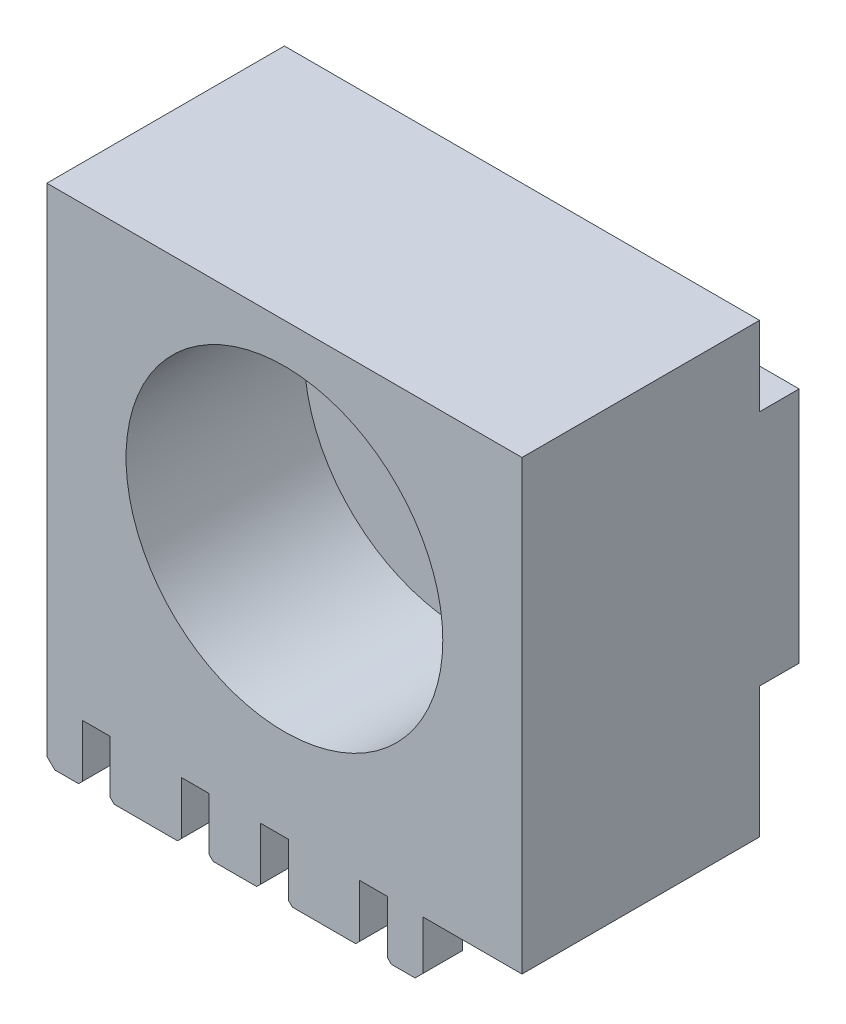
ISO-10303-21;
HEADER;
FILE_DESCRIPTION(('STEP AP214'),'2;1');
FILE_NAME('part.step','',(''),(''),'','','');
FILE_SCHEMA(('AUTOMOTIVE_DESIGN { 1 0 10303 214 1 1 1 1 }'));
ENDSEC;
DATA;
#1=APPLICATION_CONTEXT('core data for automotive mechanical design processes');
#2=APPLICATION_PROTOCOL_DEFINITION('international standard','automotive_design',2000,#1);
#3=PRODUCT_CONTEXT('',#1,'mechanical');
#4=PRODUCT('Part','Part','',(#3));
#5=PRODUCT_RELATED_PRODUCT_CATEGORY('part','',(#4));
#6=PRODUCT_DEFINITION_FORMATION('','',#4);
#7=PRODUCT_DEFINITION_CONTEXT('part definition',#1,'design');
#8=PRODUCT_DEFINITION('design','',#6,#7);
#9=PRODUCT_DEFINITION_SHAPE('','',#8);
#10=(LENGTH_UNIT() NAMED_UNIT(*) SI_UNIT(.MILLI.,.METRE.));
#11=(NAMED_UNIT(*) PLANE_ANGLE_UNIT() SI_UNIT($,.RADIAN.));
#12=(NAMED_UNIT(*) SI_UNIT($,.STERADIAN.) SOLID_ANGLE_UNIT());
#13=UNCERTAINTY_MEASURE_WITH_UNIT(LENGTH_MEASURE(1.E-05),#10,'distance_accuracy_value','');
#14=(GEOMETRIC_REPRESENTATION_CONTEXT(3) GLOBAL_UNCERTAINTY_ASSIGNED_CONTEXT((#13)) GLOBAL_UNIT_ASSIGNED_CONTEXT((#10,
#11,#12)) REPRESENTATION_CONTEXT('',''));
#15=CARTESIAN_POINT('',(0.,0.,0.));
#16=DIRECTION('',(0.,0.,1.));
#17=DIRECTION('',(1.,0.,0.));
#18=AXIS2_PLACEMENT_3D('',#15,#16,#17);
#19=CARTESIAN_POINT('',(6.,7.73500000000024,7.));
#20=DIRECTION('',(0.,0.,-1.));
#21=DIRECTION('',(-1.,0.,0.));
#22=AXIS2_PLACEMENT_3D('',#19,#20,#21);
#23=CYLINDRICAL_SURFACE('',#22,2.25);
#24=CARTESIAN_POINT('',(6.,7.73500000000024,0.));
#25=DIRECTION('',(0.,0.,1.));
#26=DIRECTION('',(1.,0.,0.));
#27=AXIS2_PLACEMENT_3D('',#24,#25,#26);
#28=CIRCLE('',#27,2.25);
#29=CARTESIAN_POINT('',(8.25,7.73500000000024,0.));
#30=VERTEX_POINT('',#29);
#31=EDGE_CURVE('E374',#30,#30,#28,.T.);
#32=ORIENTED_EDGE('',*,*,#31,.F.);
#33=EDGE_LOOP('',(#32));
#34=FACE_BOUND('',#33,.T.);
#35=CARTESIAN_POINT('',(6.,7.73500000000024,2.5));
#36=DIRECTION('',(0.,0.,1.));
#37=DIRECTION('',(1.,0.,0.));
#38=AXIS2_PLACEMENT_3D('',#35,#36,#37);
#39=CIRCLE('',#38,2.25);
#40=CARTESIAN_POINT('',(8.25,7.73500000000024,2.5));
#41=VERTEX_POINT('',#40);
#42=EDGE_CURVE('E37',#41,#41,#39,.T.);
#43=ORIENTED_EDGE('',*,*,#42,.T.);
#44=EDGE_LOOP('',(#43));
#45=FACE_BOUND('',#44,.T.);
#46=ADVANCED_FACE('F33',(#34,#45),#23,.F.);
#47=CARTESIAN_POINT('',(0.,12.7350000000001,0.));
#48=DIRECTION('',(0.,0.,-1.));
#49=DIRECTION('',(-1.,0.,0.));
#50=AXIS2_PLACEMENT_3D('',#47,#48,#49);
#51=PLANE('',#50);
#52=ORIENTED_EDGE('',*,*,#31,.T.);
#53=EDGE_LOOP('',(#52));
#54=FACE_BOUND('',#53,.T.);
#55=DIRECTION('',(0.,-1.,0.));
#56=VECTOR('',#55,1.);
#57=CARTESIAN_POINT('',(0.,0.200000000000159,0.));
#58=LINE('',#57,#56);
#59=CARTESIAN_POINT('',(0.,10.735,9.09494701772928E-13));
#60=VERTEX_POINT('',#59);
#61=CARTESIAN_POINT('',(0.,4.73500000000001,9.09494701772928E-13));
#62=VERTEX_POINT('',#61);
#63=EDGE_CURVE('E377',#60,#62,#58,.T.);
#64=ORIENTED_EDGE('',*,*,#63,.F.);
#65=DIRECTION('',(1.,0.,0.));
#66=VECTOR('',#65,1.);
#67=CARTESIAN_POINT('',(0.,10.735,9.09494701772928E-13));
#68=LINE('',#67,#66);
#69=CARTESIAN_POINT('',(12.,10.735,9.09494701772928E-13));
#70=VERTEX_POINT('',#69);
#71=EDGE_CURVE('E326',#60,#70,#68,.T.);
#72=ORIENTED_EDGE('',*,*,#71,.T.);
#73=DIRECTION('',(0.,1.,0.));
#74=VECTOR('',#73,1.);
#75=CARTESIAN_POINT('',(12.,1.43500000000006,0.));
#76=LINE('',#75,#74);
#77=CARTESIAN_POINT('',(12.,4.73500000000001,9.09494701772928E-13));
#78=VERTEX_POINT('',#77);
#79=EDGE_CURVE('E382',#78,#70,#76,.T.);
#80=ORIENTED_EDGE('',*,*,#79,.F.);
#81=DIRECTION('',(1.,0.,0.));
#82=VECTOR('',#81,1.);
#83=CARTESIAN_POINT('',(0.,4.73500000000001,9.09494701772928E-13));
#84=LINE('',#83,#82);
#85=EDGE_CURVE('E329',#62,#78,#84,.T.);
#86=ORIENTED_EDGE('',*,*,#85,.F.);
#87=EDGE_LOOP('',(#64,#72,#80,#86));
#88=FACE_BOUND('',#87,.T.);
#89=ADVANCED_FACE('F563',(#54,#88),#51,.T.);
#90=CARTESIAN_POINT('',(0.,0.200000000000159,7.));
#91=DIRECTION('',(1.,0.,0.));
#92=DIRECTION('',(0.,0.,-1.));
#93=AXIS2_PLACEMENT_3D('',#90,#91,#92);
#94=PLANE('',#93);
#95=DIRECTION('',(0.,1.,0.));
#96=VECTOR('',#95,1.);
#97=CARTESIAN_POINT('',(0.,10.735,1.00000000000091));
#98=LINE('',#97,#96);
#99=CARTESIAN_POINT('',(0.,10.735,1.00000000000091));
#100=VERTEX_POINT('',#99);
#101=CARTESIAN_POINT('',(0.,12.7350000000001,1.00000000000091));
#102=VERTEX_POINT('',#101);
#103=EDGE_CURVE('E57',#100,#102,#98,.T.);
#104=ORIENTED_EDGE('',*,*,#103,.F.);
#105=DIRECTION('',(0.,0.,1.));
#106=VECTOR('',#105,1.);
#107=CARTESIAN_POINT('',(0.,10.735,1.00000000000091));
#108=LINE('',#107,#106);
#109=EDGE_CURVE('E307',#60,#100,#108,.T.);
#110=ORIENTED_EDGE('',*,*,#109,.F.);
#111=ORIENTED_EDGE('',*,*,#63,.T.);
#112=DIRECTION('',(0.,0.,-1.));
#113=VECTOR('',#112,1.);
#114=CARTESIAN_POINT('',(0.,4.73500000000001,1.00000000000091));
#115=LINE('',#114,#113);
#116=CARTESIAN_POINT('',(0.,4.73500000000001,1.00000000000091));
#117=VERTEX_POINT('',#116);
#118=EDGE_CURVE('E302',#117,#62,#115,.T.);
#119=ORIENTED_EDGE('',*,*,#118,.F.);
#120=DIRECTION('',(0.,1.,0.));
#121=VECTOR('',#120,1.);
#122=CARTESIAN_POINT('',(0.,1.43499999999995,1.00000000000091));
#123=LINE('',#122,#121);
#124=CARTESIAN_POINT('',(0.,1.43499999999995,1.00000000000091));
#125=VERTEX_POINT('',#124);
#126=EDGE_CURVE('E300',#125,#117,#123,.T.);
#127=ORIENTED_EDGE('',*,*,#126,.F.);
#128=DIRECTION('',(0.,0.,-1.));
#129=VECTOR('',#128,1.);
#130=CARTESIAN_POINT('',(0.,1.43499999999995,6.00000000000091));
#131=LINE('',#130,#129);
#132=CARTESIAN_POINT('',(0.,1.43499999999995,6.00000000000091));
#133=VERTEX_POINT('',#132);
#134=EDGE_CURVE('E282',#133,#125,#131,.T.);
#135=ORIENTED_EDGE('',*,*,#134,.F.);
#136=DIRECTION('',(0.,1.,0.));
#137=VECTOR('',#136,1.);
#138=CARTESIAN_POINT('',(0.,0.,6.00000000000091));
#139=LINE('',#138,#137);
#140=CARTESIAN_POINT('',(0.,0.200000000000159,6.00000000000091));
#141=VERTEX_POINT('',#140);
#142=EDGE_CURVE('E272',#141,#133,#139,.T.);
#143=ORIENTED_EDGE('',*,*,#142,.F.);
#144=DIRECTION('',(0.,0.,-1.));
#145=VECTOR('',#144,1.);
#146=CARTESIAN_POINT('',(0.,0.200000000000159,7.));
#147=LINE('',#146,#145);
#148=CARTESIAN_POINT('',(0.,0.200000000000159,7.));
#149=VERTEX_POINT('',#148);
#150=EDGE_CURVE('E12',#149,#141,#147,.T.);
#151=ORIENTED_EDGE('',*,*,#150,.F.);
#152=DIRECTION('',(0.,-1.,0.));
#153=VECTOR('',#152,1.);
#154=CARTESIAN_POINT('',(0.,0.200000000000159,7.));
#155=LINE('',#154,#153);
#156=CARTESIAN_POINT('',(0.,12.7350000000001,7.));
#157=VERTEX_POINT('',#156);
#158=EDGE_CURVE('E378',#157,#149,#155,.T.);
#159=ORIENTED_EDGE('',*,*,#158,.F.);
#160=DIRECTION('',(0.,0.,-1.));
#161=VECTOR('',#160,1.);
#162=CARTESIAN_POINT('',(0.,12.7350000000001,7.));
#163=LINE('',#162,#161);
#164=EDGE_CURVE('E444',#157,#102,#163,.T.);
#165=ORIENTED_EDGE('',*,*,#164,.T.);
#166=EDGE_LOOP('',(#104,#110,#111,#119,#127,#135,#143,#151,#159,#165));
#167=FACE_BOUND('',#166,.T.);
#168=ADVANCED_FACE('F35',(#167),#94,.F.);
#169=CARTESIAN_POINT('',(0.199999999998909,1.13686837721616E-13,7.));
#170=DIRECTION('',(0.707106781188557,0.707106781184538,0.));
#171=DIRECTION('',(-0.707106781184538,0.707106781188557,0.));
#172=AXIS2_PLACEMENT_3D('',#169,#170,#171);
#173=PLANE('',#172);
#174=DIRECTION('',(-0.707106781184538,0.707106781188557,0.));
#175=VECTOR('',#174,1.);
#176=CARTESIAN_POINT('',(0.199999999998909,1.13686837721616E-13,6.00000000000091));
#177=LINE('',#176,#175);
#178=CARTESIAN_POINT('',(0.199999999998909,0.,6.00000000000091));
#179=VERTEX_POINT('',#178);
#180=EDGE_CURVE('E278',#179,#141,#177,.T.);
#181=ORIENTED_EDGE('',*,*,#180,.F.);
#182=DIRECTION('',(0.,0.,-1.));
#183=VECTOR('',#182,1.);
#184=CARTESIAN_POINT('',(0.199999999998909,1.13686837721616E-13,7.));
#185=LINE('',#184,#183);
#186=CARTESIAN_POINT('',(0.199999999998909,1.13686837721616E-13,7.));
#187=VERTEX_POINT('',#186);
#188=EDGE_CURVE('E42',#187,#179,#185,.T.);
#189=ORIENTED_EDGE('',*,*,#188,.F.);
#190=DIRECTION('',(0.707106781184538,-0.707106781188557,0.));
#191=VECTOR('',#190,1.);
#192=CARTESIAN_POINT('',(0.199999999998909,1.13686837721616E-13,7.));
#193=LINE('',#192,#191);
#194=EDGE_CURVE('E381',#149,#187,#193,.T.);
#195=ORIENTED_EDGE('',*,*,#194,.F.);
#196=ORIENTED_EDGE('',*,*,#150,.T.);
#197=EDGE_LOOP('',(#181,#189,#195,#196));
#198=FACE_BOUND('',#197,.T.);
#199=ADVANCED_FACE('F543',(#198),#173,.F.);
#200=CARTESIAN_POINT('',(0.199999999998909,1.13686837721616E-13,7.));
#201=DIRECTION('',(0.,1.,0.));
#202=DIRECTION('',(0.,0.,1.));
#203=AXIS2_PLACEMENT_3D('',#200,#201,#202);
#204=PLANE('',#203);
#205=DIRECTION('',(1.,0.,0.));
#206=VECTOR('',#205,1.);
#207=CARTESIAN_POINT('',(0.,0.,6.00000000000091));
#208=LINE('',#207,#206);
#209=CARTESIAN_POINT('',(0.799999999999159,0.,6.00000000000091));
#210=VERTEX_POINT('',#209);
#211=EDGE_CURVE('E337',#179,#210,#208,.T.);
#212=ORIENTED_EDGE('',*,*,#211,.T.);
#213=DIRECTION('',(0.,0.,-1.));
#214=VECTOR('',#213,1.);
#215=CARTESIAN_POINT('',(0.799999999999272,1.13686837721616E-13,7.));
#216=LINE('',#215,#214);
#217=CARTESIAN_POINT('',(0.799999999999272,1.13686837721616E-13,7.));
#218=VERTEX_POINT('',#217);
#219=EDGE_CURVE('E532',#218,#210,#216,.T.);
#220=ORIENTED_EDGE('',*,*,#219,.F.);
#221=DIRECTION('',(1.,0.,0.));
#222=VECTOR('',#221,1.);
#223=CARTESIAN_POINT('',(0.199999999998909,1.13686837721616E-13,7.));
#224=LINE('',#223,#222);
#225=EDGE_CURVE('E384',#187,#218,#224,.T.);
#226=ORIENTED_EDGE('',*,*,#225,.F.);
#227=ORIENTED_EDGE('',*,*,#188,.T.);
#228=EDGE_LOOP('',(#212,#220,#226,#227));
#229=FACE_BOUND('',#228,.T.);
#230=ADVANCED_FACE('F540',(#229),#204,.F.);
#231=CARTESIAN_POINT('',(0.799999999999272,1.13686837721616E-13,7.));
#232=DIRECTION('',(-0.707106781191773,0.707106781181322,0.));
#233=DIRECTION('',(-0.707106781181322,-0.707106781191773,0.));
#234=AXIS2_PLACEMENT_3D('',#231,#232,#233);
#235=PLANE('',#234);
#236=DIRECTION('',(-0.707106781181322,-0.707106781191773,0.));
#237=VECTOR('',#236,1.);
#238=CARTESIAN_POINT('',(0.799999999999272,1.13686837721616E-13,6.00000000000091));
#239=LINE('',#238,#237);
#240=CARTESIAN_POINT('',(0.899999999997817,0.100000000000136,6.00000000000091));
#241=VERTEX_POINT('',#240);
#242=EDGE_CURVE('E371',#241,#210,#239,.T.);
#243=ORIENTED_EDGE('',*,*,#242,.F.);
#244=DIRECTION('',(0.,0.,-1.));
#245=VECTOR('',#244,1.);
#246=CARTESIAN_POINT('',(0.899999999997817,0.100000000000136,7.));
#247=LINE('',#246,#245);
#248=CARTESIAN_POINT('',(0.899999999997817,0.100000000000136,7.));
#249=VERTEX_POINT('',#248);
#250=EDGE_CURVE('E529',#249,#241,#247,.T.);
#251=ORIENTED_EDGE('',*,*,#250,.F.);
#252=DIRECTION('',(0.707106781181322,0.707106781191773,0.));
#253=VECTOR('',#252,1.);
#254=CARTESIAN_POINT('',(0.799999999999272,1.13686837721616E-13,7.));
#255=LINE('',#254,#253);
#256=EDGE_CURVE('E386',#218,#249,#255,.T.);
#257=ORIENTED_EDGE('',*,*,#256,.F.);
#258=ORIENTED_EDGE('',*,*,#219,.T.);
#259=EDGE_LOOP('',(#243,#251,#257,#258));
#260=FACE_BOUND('',#259,.T.);
#261=ADVANCED_FACE('F845',(#260),#235,.F.);
#262=CARTESIAN_POINT('',(0.899999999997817,0.100000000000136,7.));
#263=DIRECTION('',(-1.,0.,0.));
#264=DIRECTION('',(0.,0.,1.));
#265=AXIS2_PLACEMENT_3D('',#262,#263,#264);
#266=PLANE('',#265);
#267=DIRECTION('',(0.,-1.,0.));
#268=VECTOR('',#267,1.);
#269=CARTESIAN_POINT('',(0.899999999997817,0.100000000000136,6.00000000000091));
#270=LINE('',#269,#268);
#271=CARTESIAN_POINT('',(0.899999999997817,1.43499999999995,6.00000000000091));
#272=VERTEX_POINT('',#271);
#273=EDGE_CURVE('E369',#272,#241,#270,.T.);
#274=ORIENTED_EDGE('',*,*,#273,.F.);
#275=DIRECTION('',(0.,0.,-1.));
#276=VECTOR('',#275,1.);
#277=CARTESIAN_POINT('',(0.899999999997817,1.43500000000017,7.));
#278=LINE('',#277,#276);
#279=CARTESIAN_POINT('',(0.899999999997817,1.43500000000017,7.));
#280=VERTEX_POINT('',#279);
#281=EDGE_CURVE('E293',#280,#272,#278,.T.);
#282=ORIENTED_EDGE('',*,*,#281,.F.);
#283=DIRECTION('',(0.,1.,0.));
#284=VECTOR('',#283,1.);
#285=CARTESIAN_POINT('',(0.899999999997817,0.100000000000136,7.));
#286=LINE('',#285,#284);
#287=EDGE_CURVE('E388',#249,#280,#286,.T.);
#288=ORIENTED_EDGE('',*,*,#287,.F.);
#289=ORIENTED_EDGE('',*,*,#250,.T.);
#290=EDGE_LOOP('',(#274,#282,#288,#289));
#291=FACE_BOUND('',#290,.T.);
#292=ADVANCED_FACE('F853',(#291),#266,.F.);
#293=CARTESIAN_POINT('',(1.59999999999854,0.100000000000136,7.));
#294=DIRECTION('',(1.,0.,0.));
#295=DIRECTION('',(0.,0.,-1.));
#296=AXIS2_PLACEMENT_3D('',#293,#294,#295);
#297=PLANE('',#296);
#298=DIRECTION('',(0.,1.,0.));
#299=VECTOR('',#298,1.);
#300=CARTESIAN_POINT('',(1.59999999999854,0.100000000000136,6.00000000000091));
#301=LINE('',#300,#299);
#302=CARTESIAN_POINT('',(1.59999999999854,0.100000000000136,6.00000000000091));
#303=VERTEX_POINT('',#302);
#304=CARTESIAN_POINT('',(1.59999999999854,1.43499999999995,6.00000000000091));
#305=VERTEX_POINT('',#304);
#306=EDGE_CURVE('E367',#303,#305,#301,.T.);
#307=ORIENTED_EDGE('',*,*,#306,.F.);
#308=DIRECTION('',(0.,0.,-1.));
#309=VECTOR('',#308,1.);
#310=CARTESIAN_POINT('',(1.59999999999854,0.100000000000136,7.));
#311=LINE('',#310,#309);
#312=CARTESIAN_POINT('',(1.59999999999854,0.100000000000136,7.));
#313=VERTEX_POINT('',#312);
#314=EDGE_CURVE('E522',#313,#303,#311,.T.);
#315=ORIENTED_EDGE('',*,*,#314,.F.);
#316=DIRECTION('',(0.,-1.,0.));
#317=VECTOR('',#316,1.);
#318=CARTESIAN_POINT('',(1.59999999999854,0.100000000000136,7.));
#319=LINE('',#318,#317);
#320=CARTESIAN_POINT('',(1.59999999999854,1.43500000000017,7.));
#321=VERTEX_POINT('',#320);
#322=EDGE_CURVE('E392',#321,#313,#319,.T.);
#323=ORIENTED_EDGE('',*,*,#322,.F.);
#324=DIRECTION('',(0.,0.,-1.));
#325=VECTOR('',#324,1.);
#326=CARTESIAN_POINT('',(1.59999999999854,1.43500000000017,7.));
#327=LINE('',#326,#325);
#328=EDGE_CURVE('E525',#321,#305,#327,.T.);
#329=ORIENTED_EDGE('',*,*,#328,.T.);
#330=EDGE_LOOP('',(#307,#315,#323,#329));
#331=FACE_BOUND('',#330,.T.);
#332=ADVANCED_FACE('F862',(#331),#297,.F.);
#333=CARTESIAN_POINT('',(1.69999999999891,1.13686837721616E-13,7.));
#334=DIRECTION('',(0.707106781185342,0.707106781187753,0.));
#335=DIRECTION('',(-0.707106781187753,0.707106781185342,0.));
#336=AXIS2_PLACEMENT_3D('',#333,#334,#335);
#337=PLANE('',#336);
#338=DIRECTION('',(-0.707106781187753,0.707106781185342,0.));
#339=VECTOR('',#338,1.);
#340=CARTESIAN_POINT('',(1.69999999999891,1.13686837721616E-13,6.00000000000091));
#341=LINE('',#340,#339);
#342=CARTESIAN_POINT('',(1.69999999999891,0.,6.00000000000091));
#343=VERTEX_POINT('',#342);
#344=EDGE_CURVE('E365',#343,#303,#341,.T.);
#345=ORIENTED_EDGE('',*,*,#344,.F.);
#346=DIRECTION('',(0.,0.,-1.));
#347=VECTOR('',#346,1.);
#348=CARTESIAN_POINT('',(1.69999999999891,1.13686837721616E-13,7.));
#349=LINE('',#348,#347);
#350=CARTESIAN_POINT('',(1.69999999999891,1.13686837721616E-13,7.));
#351=VERTEX_POINT('',#350);
#352=EDGE_CURVE('E519',#351,#343,#349,.T.);
#353=ORIENTED_EDGE('',*,*,#352,.F.);
#354=DIRECTION('',(0.707106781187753,-0.707106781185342,0.));
#355=VECTOR('',#354,1.);
#356=CARTESIAN_POINT('',(1.69999999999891,1.13686837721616E-13,7.));
#357=LINE('',#356,#355);
#358=EDGE_CURVE('E394',#313,#351,#357,.T.);
#359=ORIENTED_EDGE('',*,*,#358,.F.);
#360=ORIENTED_EDGE('',*,*,#314,.T.);
#361=EDGE_LOOP('',(#345,#353,#359,#360));
#362=FACE_BOUND('',#361,.T.);
#363=ADVANCED_FACE('F871',(#362),#337,.F.);
#364=CARTESIAN_POINT('',(1.69999999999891,1.13686837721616E-13,7.));
#365=DIRECTION('',(0.,1.,0.));
#366=DIRECTION('',(-1.,0.,0.));
#367=AXIS2_PLACEMENT_3D('',#364,#365,#366);
#368=PLANE('',#367);
#369=CARTESIAN_POINT('',(3.29999999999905,0.,6.00000000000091));
#370=VERTEX_POINT('',#369);
#371=EDGE_CURVE('E602',#343,#370,#208,.T.);
#372=ORIENTED_EDGE('',*,*,#371,.T.);
#373=DIRECTION('',(0.,0.,-1.));
#374=VECTOR('',#373,1.);
#375=CARTESIAN_POINT('',(3.29999999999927,2.27373675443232E-13,7.));
#376=LINE('',#375,#374);
#377=CARTESIAN_POINT('',(3.29999999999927,2.27373675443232E-13,7.));
#378=VERTEX_POINT('',#377);
#379=EDGE_CURVE('E516',#378,#370,#376,.T.);
#380=ORIENTED_EDGE('',*,*,#379,.F.);
#381=DIRECTION('',(1.,0.,0.));
#382=VECTOR('',#381,1.);
#383=CARTESIAN_POINT('',(1.69999999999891,1.13686837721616E-13,7.));
#384=LINE('',#383,#382);
#385=EDGE_CURVE('E396',#351,#378,#384,.T.);
#386=ORIENTED_EDGE('',*,*,#385,.F.);
#387=ORIENTED_EDGE('',*,*,#352,.T.);
#388=EDGE_LOOP('',(#372,#380,#386,#387));
#389=FACE_BOUND('',#388,.T.);
#390=ADVANCED_FACE('F880',(#389),#368,.F.);
#391=CARTESIAN_POINT('',(3.39999999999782,0.10000000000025,7.));
#392=DIRECTION('',(-0.707106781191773,0.707106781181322,0.));
#393=DIRECTION('',(-0.707106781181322,-0.707106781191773,0.));
#394=AXIS2_PLACEMENT_3D('',#391,#392,#393);
#395=PLANE('',#394);
#396=DIRECTION('',(-0.707106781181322,-0.707106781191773,0.));
#397=VECTOR('',#396,1.);
#398=CARTESIAN_POINT('',(3.39999999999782,0.10000000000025,6.00000000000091));
#399=LINE('',#398,#397);
#400=CARTESIAN_POINT('',(3.39999999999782,0.10000000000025,6.00000000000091));
#401=VERTEX_POINT('',#400);
#402=EDGE_CURVE('E363',#401,#370,#399,.T.);
#403=ORIENTED_EDGE('',*,*,#402,.F.);
#404=DIRECTION('',(0.,0.,-1.));
#405=VECTOR('',#404,1.);
#406=CARTESIAN_POINT('',(3.39999999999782,0.10000000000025,7.));
#407=LINE('',#406,#405);
#408=CARTESIAN_POINT('',(3.39999999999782,0.10000000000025,7.));
#409=VERTEX_POINT('',#408);
#410=EDGE_CURVE('E513',#409,#401,#407,.T.);
#411=ORIENTED_EDGE('',*,*,#410,.F.);
#412=DIRECTION('',(0.707106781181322,0.707106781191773,0.));
#413=VECTOR('',#412,1.);
#414=CARTESIAN_POINT('',(3.39999999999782,0.10000000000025,7.));
#415=LINE('',#414,#413);
#416=EDGE_CURVE('E398',#378,#409,#415,.T.);
#417=ORIENTED_EDGE('',*,*,#416,.F.);
#418=ORIENTED_EDGE('',*,*,#379,.T.);
#419=EDGE_LOOP('',(#403,#411,#417,#418));
#420=FACE_BOUND('',#419,.T.);
#421=ADVANCED_FACE('F889',(#420),#395,.F.);
#422=CARTESIAN_POINT('',(3.39999999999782,0.10000000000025,7.));
#423=DIRECTION('',(-1.,0.,0.));
#424=DIRECTION('',(0.,0.,1.));
#425=AXIS2_PLACEMENT_3D('',#422,#423,#424);
#426=PLANE('',#425);
#427=DIRECTION('',(0.,-1.,0.));
#428=VECTOR('',#427,1.);
#429=CARTESIAN_POINT('',(3.39999999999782,0.10000000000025,6.00000000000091));
#430=LINE('',#429,#428);
#431=CARTESIAN_POINT('',(3.39999999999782,1.43499999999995,6.00000000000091));
#432=VERTEX_POINT('',#431);
#433=EDGE_CURVE('E361',#432,#401,#430,.T.);
#434=ORIENTED_EDGE('',*,*,#433,.F.);
#435=DIRECTION('',(0.,0.,-1.));
#436=VECTOR('',#435,1.);
#437=CARTESIAN_POINT('',(3.39999999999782,1.43500000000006,7.));
#438=LINE('',#437,#436);
#439=CARTESIAN_POINT('',(3.39999999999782,1.43500000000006,7.));
#440=VERTEX_POINT('',#439);
#441=EDGE_CURVE('E510',#440,#432,#438,.T.);
#442=ORIENTED_EDGE('',*,*,#441,.F.);
#443=DIRECTION('',(0.,1.,0.));
#444=VECTOR('',#443,1.);
#445=CARTESIAN_POINT('',(3.39999999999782,0.10000000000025,7.));
#446=LINE('',#445,#444);
#447=EDGE_CURVE('E400',#409,#440,#446,.T.);
#448=ORIENTED_EDGE('',*,*,#447,.F.);
#449=ORIENTED_EDGE('',*,*,#410,.T.);
#450=EDGE_LOOP('',(#434,#442,#448,#449));
#451=FACE_BOUND('',#450,.T.);
#452=ADVANCED_FACE('F897',(#451),#426,.F.);
#453=CARTESIAN_POINT('',(4.09999999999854,0.100000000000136,7.));
#454=DIRECTION('',(1.,0.,0.));
#455=DIRECTION('',(0.,0.,-1.));
#456=AXIS2_PLACEMENT_3D('',#453,#454,#455);
#457=PLANE('',#456);
#458=DIRECTION('',(0.,1.,0.));
#459=VECTOR('',#458,1.);
#460=CARTESIAN_POINT('',(4.09999999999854,0.100000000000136,6.00000000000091));
#461=LINE('',#460,#459);
#462=CARTESIAN_POINT('',(4.09999999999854,0.100000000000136,6.00000000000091));
#463=VERTEX_POINT('',#462);
#464=CARTESIAN_POINT('',(4.09999999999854,1.43499999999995,6.00000000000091));
#465=VERTEX_POINT('',#464);
#466=EDGE_CURVE('E359',#463,#465,#461,.T.);
#467=ORIENTED_EDGE('',*,*,#466,.F.);
#468=DIRECTION('',(0.,0.,-1.));
#469=VECTOR('',#468,1.);
#470=CARTESIAN_POINT('',(4.09999999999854,0.100000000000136,7.));
#471=LINE('',#470,#469);
#472=CARTESIAN_POINT('',(4.09999999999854,0.100000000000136,7.));
#473=VERTEX_POINT('',#472);
#474=EDGE_CURVE('E504',#473,#463,#471,.T.);
#475=ORIENTED_EDGE('',*,*,#474,.F.);
#476=DIRECTION('',(0.,-1.,0.));
#477=VECTOR('',#476,1.);
#478=CARTESIAN_POINT('',(4.09999999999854,0.100000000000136,7.));
#479=LINE('',#478,#477);
#480=CARTESIAN_POINT('',(4.09999999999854,1.43500000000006,7.));
#481=VERTEX_POINT('',#480);
#482=EDGE_CURVE('E404',#481,#473,#479,.T.);
#483=ORIENTED_EDGE('',*,*,#482,.F.);
#484=DIRECTION('',(0.,0.,-1.));
#485=VECTOR('',#484,1.);
#486=CARTESIAN_POINT('',(4.09999999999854,1.43500000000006,7.));
#487=LINE('',#486,#485);
#488=EDGE_CURVE('E507',#481,#465,#487,.T.);
#489=ORIENTED_EDGE('',*,*,#488,.T.);
#490=EDGE_LOOP('',(#467,#475,#483,#489));
#491=FACE_BOUND('',#490,.T.);
#492=ADVANCED_FACE('F906',(#491),#457,.F.);
#493=CARTESIAN_POINT('',(4.19999999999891,1.13686837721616E-13,7.));
#494=DIRECTION('',(0.707106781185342,0.707106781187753,0.));
#495=DIRECTION('',(-0.707106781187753,0.707106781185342,0.));
#496=AXIS2_PLACEMENT_3D('',#493,#494,#495);
#497=PLANE('',#496);
#498=DIRECTION('',(-0.707106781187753,0.707106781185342,0.));
#499=VECTOR('',#498,1.);
#500=CARTESIAN_POINT('',(4.19999999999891,1.13686837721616E-13,6.00000000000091));
#501=LINE('',#500,#499);
#502=CARTESIAN_POINT('',(4.19999999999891,0.,6.00000000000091));
#503=VERTEX_POINT('',#502);
#504=EDGE_CURVE('E357',#503,#463,#501,.T.);
#505=ORIENTED_EDGE('',*,*,#504,.F.);
#506=DIRECTION('',(0.,0.,-1.));
#507=VECTOR('',#506,1.);
#508=CARTESIAN_POINT('',(4.19999999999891,1.13686837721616E-13,7.));
#509=LINE('',#508,#507);
#510=CARTESIAN_POINT('',(4.19999999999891,1.13686837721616E-13,7.));
#511=VERTEX_POINT('',#510);
#512=EDGE_CURVE('E501',#511,#503,#509,.T.);
#513=ORIENTED_EDGE('',*,*,#512,.F.);
#514=DIRECTION('',(0.707106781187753,-0.707106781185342,0.));
#515=VECTOR('',#514,1.);
#516=CARTESIAN_POINT('',(4.19999999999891,1.13686837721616E-13,7.));
#517=LINE('',#516,#515);
#518=EDGE_CURVE('E406',#473,#511,#517,.T.);
#519=ORIENTED_EDGE('',*,*,#518,.F.);
#520=ORIENTED_EDGE('',*,*,#474,.T.);
#521=EDGE_LOOP('',(#505,#513,#519,#520));
#522=FACE_BOUND('',#521,.T.);
#523=ADVANCED_FACE('F915',(#522),#497,.F.);
#524=CARTESIAN_POINT('',(4.19999999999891,1.13686837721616E-13,7.));
#525=DIRECTION('',(-1.0335167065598E-13,1.,0.));
#526=DIRECTION('',(-1.,-1.0335167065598E-13,0.));
#527=AXIS2_PLACEMENT_3D('',#524,#525,#526);
#528=PLANE('',#527);
#529=CARTESIAN_POINT('',(5.29999999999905,0.,6.00000000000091));
#530=VERTEX_POINT('',#529);
#531=EDGE_CURVE('E604',#503,#530,#208,.T.);
#532=ORIENTED_EDGE('',*,*,#531,.T.);
#533=DIRECTION('',(0.,0.,-1.));
#534=VECTOR('',#533,1.);
#535=CARTESIAN_POINT('',(5.29999999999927,2.27373675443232E-13,7.));
#536=LINE('',#535,#534);
#537=CARTESIAN_POINT('',(5.29999999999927,2.27373675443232E-13,7.));
#538=VERTEX_POINT('',#537);
#539=EDGE_CURVE('E498',#538,#530,#536,.T.);
#540=ORIENTED_EDGE('',*,*,#539,.F.);
#541=DIRECTION('',(1.,1.0335167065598E-13,0.));
#542=VECTOR('',#541,1.);
#543=CARTESIAN_POINT('',(4.19999999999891,1.13686837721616E-13,7.));
#544=LINE('',#543,#542);
#545=EDGE_CURVE('E408',#511,#538,#544,.T.);
#546=ORIENTED_EDGE('',*,*,#545,.F.);
#547=ORIENTED_EDGE('',*,*,#512,.T.);
#548=EDGE_LOOP('',(#532,#540,#546,#547));
#549=FACE_BOUND('',#548,.T.);
#550=ADVANCED_FACE('F924',(#549),#528,.F.);
#551=CARTESIAN_POINT('',(5.29999999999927,2.27373675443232E-13,7.));
#552=DIRECTION('',(-0.707106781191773,0.707106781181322,0.));
#553=DIRECTION('',(-0.707106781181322,-0.707106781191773,0.));
#554=AXIS2_PLACEMENT_3D('',#551,#552,#553);
#555=PLANE('',#554);
#556=DIRECTION('',(-0.707106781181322,-0.707106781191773,0.));
#557=VECTOR('',#556,1.);
#558=CARTESIAN_POINT('',(5.29999999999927,2.27373675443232E-13,6.00000000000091));
#559=LINE('',#558,#557);
#560=CARTESIAN_POINT('',(5.39999999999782,0.10000000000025,6.00000000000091));
#561=VERTEX_POINT('',#560);
#562=EDGE_CURVE('E355',#561,#530,#559,.T.);
#563=ORIENTED_EDGE('',*,*,#562,.F.);
#564=DIRECTION('',(0.,0.,-1.));
#565=VECTOR('',#564,1.);
#566=CARTESIAN_POINT('',(5.39999999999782,0.10000000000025,7.));
#567=LINE('',#566,#565);
#568=CARTESIAN_POINT('',(5.39999999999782,0.10000000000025,7.));
#569=VERTEX_POINT('',#568);
#570=EDGE_CURVE('E495',#569,#561,#567,.T.);
#571=ORIENTED_EDGE('',*,*,#570,.F.);
#572=DIRECTION('',(0.707106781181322,0.707106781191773,0.));
#573=VECTOR('',#572,1.);
#574=CARTESIAN_POINT('',(5.29999999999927,2.27373675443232E-13,7.));
#575=LINE('',#574,#573);
#576=EDGE_CURVE('E410',#538,#569,#575,.T.);
#577=ORIENTED_EDGE('',*,*,#576,.F.);
#578=ORIENTED_EDGE('',*,*,#539,.T.);
#579=EDGE_LOOP('',(#563,#571,#577,#578));
#580=FACE_BOUND('',#579,.T.);
#581=ADVANCED_FACE('F933',(#580),#555,.F.);
#582=CARTESIAN_POINT('',(5.39999999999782,0.10000000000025,7.));
#583=DIRECTION('',(-1.,0.,0.));
#584=DIRECTION('',(0.,0.,1.));
#585=AXIS2_PLACEMENT_3D('',#582,#583,#584);
#586=PLANE('',#585);
#587=DIRECTION('',(0.,-1.,0.));
#588=VECTOR('',#587,1.);
#589=CARTESIAN_POINT('',(5.39999999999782,0.10000000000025,6.00000000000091));
#590=LINE('',#589,#588);
#591=CARTESIAN_POINT('',(5.39999999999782,1.43499999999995,6.00000000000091));
#592=VERTEX_POINT('',#591);
#593=EDGE_CURVE('E353',#592,#561,#590,.T.);
#594=ORIENTED_EDGE('',*,*,#593,.F.);
#595=DIRECTION('',(0.,0.,-1.));
#596=VECTOR('',#595,1.);
#597=CARTESIAN_POINT('',(5.39999999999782,1.43500000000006,7.));
#598=LINE('',#597,#596);
#599=CARTESIAN_POINT('',(5.39999999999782,1.43500000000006,7.));
#600=VERTEX_POINT('',#599);
#601=EDGE_CURVE('E492',#600,#592,#598,.T.);
#602=ORIENTED_EDGE('',*,*,#601,.F.);
#603=DIRECTION('',(0.,1.,0.));
#604=VECTOR('',#603,1.);
#605=CARTESIAN_POINT('',(5.39999999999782,0.10000000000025,7.));
#606=LINE('',#605,#604);
#607=EDGE_CURVE('E412',#569,#600,#606,.T.);
#608=ORIENTED_EDGE('',*,*,#607,.F.);
#609=ORIENTED_EDGE('',*,*,#570,.T.);
#610=EDGE_LOOP('',(#594,#602,#608,#609));
#611=FACE_BOUND('',#610,.T.);
#612=ADVANCED_FACE('F941',(#611),#586,.F.);
#613=CARTESIAN_POINT('',(6.09999999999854,0.100000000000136,7.));
#614=DIRECTION('',(1.,0.,0.));
#615=DIRECTION('',(0.,0.,-1.));
#616=AXIS2_PLACEMENT_3D('',#613,#614,#615);
#617=PLANE('',#616);
#618=DIRECTION('',(0.,1.,0.));
#619=VECTOR('',#618,1.);
#620=CARTESIAN_POINT('',(6.09999999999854,0.100000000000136,6.00000000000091));
#621=LINE('',#620,#619);
#622=CARTESIAN_POINT('',(6.09999999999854,0.100000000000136,6.00000000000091));
#623=VERTEX_POINT('',#622);
#624=CARTESIAN_POINT('',(6.09999999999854,1.43499999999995,6.00000000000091));
#625=VERTEX_POINT('',#624);
#626=EDGE_CURVE('E351',#623,#625,#621,.T.);
#627=ORIENTED_EDGE('',*,*,#626,.F.);
#628=DIRECTION('',(0.,0.,-1.));
#629=VECTOR('',#628,1.);
#630=CARTESIAN_POINT('',(6.09999999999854,0.100000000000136,7.));
#631=LINE('',#630,#629);
#632=CARTESIAN_POINT('',(6.09999999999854,0.100000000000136,7.));
#633=VERTEX_POINT('',#632);
#634=EDGE_CURVE('E486',#633,#623,#631,.T.);
#635=ORIENTED_EDGE('',*,*,#634,.F.);
#636=DIRECTION('',(0.,-1.,0.));
#637=VECTOR('',#636,1.);
#638=CARTESIAN_POINT('',(6.09999999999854,0.100000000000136,7.));
#639=LINE('',#638,#637);
#640=CARTESIAN_POINT('',(6.09999999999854,1.43500000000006,7.));
#641=VERTEX_POINT('',#640);
#642=EDGE_CURVE('E416',#641,#633,#639,.T.);
#643=ORIENTED_EDGE('',*,*,#642,.F.);
#644=DIRECTION('',(0.,0.,-1.));
#645=VECTOR('',#644,1.);
#646=CARTESIAN_POINT('',(6.09999999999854,1.43500000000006,7.));
#647=LINE('',#646,#645);
#648=EDGE_CURVE('E489',#641,#625,#647,.T.);
#649=ORIENTED_EDGE('',*,*,#648,.T.);
#650=EDGE_LOOP('',(#627,#635,#643,#649));
#651=FACE_BOUND('',#650,.T.);
#652=ADVANCED_FACE('F634',(#651),#617,.F.);
#653=CARTESIAN_POINT('',(6.19999999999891,1.13686837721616E-13,7.));
#654=DIRECTION('',(0.707106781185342,0.707106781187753,0.));
#655=DIRECTION('',(-0.707106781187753,0.707106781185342,0.));
#656=AXIS2_PLACEMENT_3D('',#653,#654,#655);
#657=PLANE('',#656);
#658=DIRECTION('',(-0.707106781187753,0.707106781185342,0.));
#659=VECTOR('',#658,1.);
#660=CARTESIAN_POINT('',(6.19999999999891,1.13686837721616E-13,6.00000000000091));
#661=LINE('',#660,#659);
#662=CARTESIAN_POINT('',(6.19999999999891,0.,6.00000000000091));
#663=VERTEX_POINT('',#662);
#664=EDGE_CURVE('E349',#663,#623,#661,.T.);
#665=ORIENTED_EDGE('',*,*,#664,.F.);
#666=DIRECTION('',(0.,0.,-1.));
#667=VECTOR('',#666,1.);
#668=CARTESIAN_POINT('',(6.19999999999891,1.13686837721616E-13,7.));
#669=LINE('',#668,#667);
#670=CARTESIAN_POINT('',(6.19999999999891,1.13686837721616E-13,7.));
#671=VERTEX_POINT('',#670);
#672=EDGE_CURVE('E483',#671,#663,#669,.T.);
#673=ORIENTED_EDGE('',*,*,#672,.F.);
#674=DIRECTION('',(0.707106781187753,-0.707106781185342,0.));
#675=VECTOR('',#674,1.);
#676=CARTESIAN_POINT('',(6.19999999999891,1.13686837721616E-13,7.));
#677=LINE('',#676,#675);
#678=EDGE_CURVE('E418',#633,#671,#677,.T.);
#679=ORIENTED_EDGE('',*,*,#678,.F.);
#680=ORIENTED_EDGE('',*,*,#634,.T.);
#681=EDGE_LOOP('',(#665,#673,#679,#680));
#682=FACE_BOUND('',#681,.T.);
#683=ADVANCED_FACE('F629',(#682),#657,.F.);
#684=CARTESIAN_POINT('',(6.19999999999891,1.13686837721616E-13,7.));
#685=DIRECTION('',(0.,1.,0.));
#686=DIRECTION('',(0.,0.,1.));
#687=AXIS2_PLACEMENT_3D('',#684,#685,#686);
#688=PLANE('',#687);
#689=CARTESIAN_POINT('',(7.79999999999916,0.,6.00000000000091));
#690=VERTEX_POINT('',#689);
#691=EDGE_CURVE('E336',#663,#690,#208,.T.);
#692=ORIENTED_EDGE('',*,*,#691,.T.);
#693=DIRECTION('',(0.,0.,-1.));
#694=VECTOR('',#693,1.);
#695=CARTESIAN_POINT('',(7.79999999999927,1.13686837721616E-13,7.));
#696=LINE('',#695,#694);
#697=CARTESIAN_POINT('',(7.79999999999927,1.13686837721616E-13,7.));
#698=VERTEX_POINT('',#697);
#699=EDGE_CURVE('E480',#698,#690,#696,.T.);
#700=ORIENTED_EDGE('',*,*,#699,.F.);
#701=DIRECTION('',(1.,0.,0.));
#702=VECTOR('',#701,1.);
#703=CARTESIAN_POINT('',(6.19999999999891,1.13686837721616E-13,7.));
#704=LINE('',#703,#702);
#705=EDGE_CURVE('E420',#671,#698,#704,.T.);
#706=ORIENTED_EDGE('',*,*,#705,.F.);
#707=ORIENTED_EDGE('',*,*,#672,.T.);
#708=EDGE_LOOP('',(#692,#700,#706,#707));
#709=FACE_BOUND('',#708,.T.);
#710=ADVANCED_FACE('F613',(#709),#688,.F.);
#711=CARTESIAN_POINT('',(7.89999999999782,0.100000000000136,7.));
#712=DIRECTION('',(-0.707106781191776,0.707106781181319,0.));
#713=DIRECTION('',(-0.707106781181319,-0.707106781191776,0.));
#714=AXIS2_PLACEMENT_3D('',#711,#712,#713);
#715=PLANE('',#714);
#716=DIRECTION('',(-0.707106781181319,-0.707106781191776,0.));
#717=VECTOR('',#716,1.);
#718=CARTESIAN_POINT('',(7.89999999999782,0.100000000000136,6.00000000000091));
#719=LINE('',#718,#717);
#720=CARTESIAN_POINT('',(7.89999999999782,0.100000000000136,6.00000000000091));
#721=VERTEX_POINT('',#720);
#722=EDGE_CURVE('E347',#721,#690,#719,.T.);
#723=ORIENTED_EDGE('',*,*,#722,.F.);
#724=DIRECTION('',(0.,0.,-1.));
#725=VECTOR('',#724,1.);
#726=CARTESIAN_POINT('',(7.89999999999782,0.100000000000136,7.));
#727=LINE('',#726,#725);
#728=CARTESIAN_POINT('',(7.89999999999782,0.100000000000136,7.));
#729=VERTEX_POINT('',#728);
#730=EDGE_CURVE('E477',#729,#721,#727,.T.);
#731=ORIENTED_EDGE('',*,*,#730,.F.);
#732=DIRECTION('',(0.707106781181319,0.707106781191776,0.));
#733=VECTOR('',#732,1.);
#734=CARTESIAN_POINT('',(7.89999999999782,0.100000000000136,7.));
#735=LINE('',#734,#733);
#736=EDGE_CURVE('E422',#698,#729,#735,.T.);
#737=ORIENTED_EDGE('',*,*,#736,.F.);
#738=ORIENTED_EDGE('',*,*,#699,.T.);
#739=EDGE_LOOP('',(#723,#731,#737,#738));
#740=FACE_BOUND('',#739,.T.);
#741=ADVANCED_FACE('F621',(#740),#715,.F.);
#742=CARTESIAN_POINT('',(7.89999999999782,0.100000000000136,7.));
#743=DIRECTION('',(-1.,0.,0.));
#744=DIRECTION('',(0.,0.,1.));
#745=AXIS2_PLACEMENT_3D('',#742,#743,#744);
#746=PLANE('',#745);
#747=DIRECTION('',(0.,-1.,0.));
#748=VECTOR('',#747,1.);
#749=CARTESIAN_POINT('',(7.89999999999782,0.100000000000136,6.00000000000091));
#750=LINE('',#749,#748);
#751=CARTESIAN_POINT('',(7.89999999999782,1.43499999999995,6.00000000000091));
#752=VERTEX_POINT('',#751);
#753=EDGE_CURVE('E345',#752,#721,#750,.T.);
#754=ORIENTED_EDGE('',*,*,#753,.F.);
#755=DIRECTION('',(0.,0.,-1.));
#756=VECTOR('',#755,1.);
#757=CARTESIAN_POINT('',(7.89999999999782,1.43500000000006,7.));
#758=LINE('',#757,#756);
#759=CARTESIAN_POINT('',(7.89999999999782,1.43500000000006,7.));
#760=VERTEX_POINT('',#759);
#761=EDGE_CURVE('E474',#760,#752,#758,.T.);
#762=ORIENTED_EDGE('',*,*,#761,.F.);
#763=DIRECTION('',(0.,1.,0.));
#764=VECTOR('',#763,1.);
#765=CARTESIAN_POINT('',(7.89999999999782,0.100000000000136,7.));
#766=LINE('',#765,#764);
#767=EDGE_CURVE('E424',#729,#760,#766,.T.);
#768=ORIENTED_EDGE('',*,*,#767,.F.);
#769=ORIENTED_EDGE('',*,*,#730,.T.);
#770=EDGE_LOOP('',(#754,#762,#768,#769));
#771=FACE_BOUND('',#770,.T.);
#772=ADVANCED_FACE('F639',(#771),#746,.F.);
#773=CARTESIAN_POINT('',(8.59999999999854,0.100000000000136,7.));
#774=DIRECTION('',(1.,0.,0.));
#775=DIRECTION('',(0.,0.,-1.));
#776=AXIS2_PLACEMENT_3D('',#773,#774,#775);
#777=PLANE('',#776);
#778=DIRECTION('',(0.,1.,0.));
#779=VECTOR('',#778,1.);
#780=CARTESIAN_POINT('',(8.59999999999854,0.100000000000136,6.00000000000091));
#781=LINE('',#780,#779);
#782=CARTESIAN_POINT('',(8.59999999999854,0.100000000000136,6.00000000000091));
#783=VERTEX_POINT('',#782);
#784=CARTESIAN_POINT('',(8.59999999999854,1.43499999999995,6.00000000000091));
#785=VERTEX_POINT('',#784);
#786=EDGE_CURVE('E343',#783,#785,#781,.T.);
#787=ORIENTED_EDGE('',*,*,#786,.F.);
#788=DIRECTION('',(0.,0.,-1.));
#789=VECTOR('',#788,1.);
#790=CARTESIAN_POINT('',(8.59999999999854,0.100000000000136,7.));
#791=LINE('',#790,#789);
#792=CARTESIAN_POINT('',(8.59999999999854,0.100000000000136,7.));
#793=VERTEX_POINT('',#792);
#794=EDGE_CURVE('E468',#793,#783,#791,.T.);
#795=ORIENTED_EDGE('',*,*,#794,.F.);
#796=DIRECTION('',(0.,-1.,0.));
#797=VECTOR('',#796,1.);
#798=CARTESIAN_POINT('',(8.59999999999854,0.100000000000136,7.));
#799=LINE('',#798,#797);
#800=CARTESIAN_POINT('',(8.59999999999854,1.43500000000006,7.));
#801=VERTEX_POINT('',#800);
#802=EDGE_CURVE('E428',#801,#793,#799,.T.);
#803=ORIENTED_EDGE('',*,*,#802,.F.);
#804=DIRECTION('',(0.,0.,-1.));
#805=VECTOR('',#804,1.);
#806=CARTESIAN_POINT('',(8.59999999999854,1.43500000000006,7.));
#807=LINE('',#806,#805);
#808=EDGE_CURVE('E471',#801,#785,#807,.T.);
#809=ORIENTED_EDGE('',*,*,#808,.T.);
#810=EDGE_LOOP('',(#787,#795,#803,#809));
#811=FACE_BOUND('',#810,.T.);
#812=ADVANCED_FACE('F597',(#811),#777,.F.);
#813=CARTESIAN_POINT('',(8.69999999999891,1.13686837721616E-13,7.));
#814=DIRECTION('',(0.707106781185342,0.707106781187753,0.));
#815=DIRECTION('',(-0.707106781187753,0.707106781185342,0.));
#816=AXIS2_PLACEMENT_3D('',#813,#814,#815);
#817=PLANE('',#816);
#818=DIRECTION('',(-0.707106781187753,0.707106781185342,0.));
#819=VECTOR('',#818,1.);
#820=CARTESIAN_POINT('',(8.69999999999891,1.13686837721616E-13,6.00000000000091));
#821=LINE('',#820,#819);
#822=CARTESIAN_POINT('',(8.69999999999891,0.,6.00000000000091));
#823=VERTEX_POINT('',#822);
#824=EDGE_CURVE('E341',#823,#783,#821,.T.);
#825=ORIENTED_EDGE('',*,*,#824,.F.);
#826=DIRECTION('',(0.,0.,-1.));
#827=VECTOR('',#826,1.);
#828=CARTESIAN_POINT('',(8.69999999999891,1.13686837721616E-13,7.));
#829=LINE('',#828,#827);
#830=CARTESIAN_POINT('',(8.69999999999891,1.13686837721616E-13,7.));
#831=VERTEX_POINT('',#830);
#832=EDGE_CURVE('E465',#831,#823,#829,.T.);
#833=ORIENTED_EDGE('',*,*,#832,.F.);
#834=DIRECTION('',(0.707106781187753,-0.707106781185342,0.));
#835=VECTOR('',#834,1.);
#836=CARTESIAN_POINT('',(8.69999999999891,1.13686837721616E-13,7.));
#837=LINE('',#836,#835);
#838=EDGE_CURVE('E430',#793,#831,#837,.T.);
#839=ORIENTED_EDGE('',*,*,#838,.F.);
#840=ORIENTED_EDGE('',*,*,#794,.T.);
#841=EDGE_LOOP('',(#825,#833,#839,#840));
#842=FACE_BOUND('',#841,.T.);
#843=ADVANCED_FACE('F592',(#842),#817,.F.);
#844=CARTESIAN_POINT('',(8.69999999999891,1.13686837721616E-13,7.));
#845=DIRECTION('',(-1.89478062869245E-13,1.,0.));
#846=DIRECTION('',(-1.,-1.89478062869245E-13,0.));
#847=AXIS2_PLACEMENT_3D('',#844,#845,#846);
#848=PLANE('',#847);
#849=CARTESIAN_POINT('',(9.29999999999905,0.,6.00000000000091));
#850=VERTEX_POINT('',#849);
#851=EDGE_CURVE('E311',#823,#850,#208,.T.);
#852=ORIENTED_EDGE('',*,*,#851,.T.);
#853=DIRECTION('',(0.,0.,-1.));
#854=VECTOR('',#853,1.);
#855=CARTESIAN_POINT('',(9.29999999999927,2.27373675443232E-13,7.));
#856=LINE('',#855,#854);
#857=CARTESIAN_POINT('',(9.29999999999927,2.27373675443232E-13,7.));
#858=VERTEX_POINT('',#857);
#859=EDGE_CURVE('E462',#858,#850,#856,.T.);
#860=ORIENTED_EDGE('',*,*,#859,.F.);
#861=DIRECTION('',(1.,1.89478062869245E-13,0.));
#862=VECTOR('',#861,1.);
#863=CARTESIAN_POINT('',(8.69999999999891,1.13686837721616E-13,7.));
#864=LINE('',#863,#862);
#865=EDGE_CURVE('E432',#831,#858,#864,.T.);
#866=ORIENTED_EDGE('',*,*,#865,.F.);
#867=ORIENTED_EDGE('',*,*,#832,.T.);
#868=EDGE_LOOP('',(#852,#860,#866,#867));
#869=FACE_BOUND('',#868,.T.);
#870=ADVANCED_FACE('F587',(#869),#848,.F.);
#871=CARTESIAN_POINT('',(9.29999999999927,2.27373675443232E-13,7.));
#872=DIRECTION('',(-0.707106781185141,0.707106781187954,0.));
#873=DIRECTION('',(-0.707106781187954,-0.707106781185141,0.));
#874=AXIS2_PLACEMENT_3D('',#871,#872,#873);
#875=PLANE('',#874);
#876=DIRECTION('',(-0.707106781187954,-0.707106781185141,0.));
#877=VECTOR('',#876,1.);
#878=CARTESIAN_POINT('',(9.29999999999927,2.27373675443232E-13,6.00000000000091));
#879=LINE('',#878,#877);
#880=CARTESIAN_POINT('',(9.5,0.200000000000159,6.00000000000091));
#881=VERTEX_POINT('',#880);
#882=EDGE_CURVE('E339',#881,#850,#879,.T.);
#883=ORIENTED_EDGE('',*,*,#882,.F.);
#884=DIRECTION('',(0.,0.,-1.));
#885=VECTOR('',#884,1.);
#886=CARTESIAN_POINT('',(9.5,0.200000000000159,7.));
#887=LINE('',#886,#885);
#888=CARTESIAN_POINT('',(9.5,0.200000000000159,7.));
#889=VERTEX_POINT('',#888);
#890=EDGE_CURVE('E459',#889,#881,#887,.T.);
#891=ORIENTED_EDGE('',*,*,#890,.F.);
#892=DIRECTION('',(0.707106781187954,0.707106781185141,0.));
#893=VECTOR('',#892,1.);
#894=CARTESIAN_POINT('',(9.29999999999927,2.27373675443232E-13,7.));
#895=LINE('',#894,#893);
#896=EDGE_CURVE('E434',#858,#889,#895,.T.);
#897=ORIENTED_EDGE('',*,*,#896,.F.);
#898=ORIENTED_EDGE('',*,*,#859,.T.);
#899=EDGE_LOOP('',(#883,#891,#897,#898));
#900=FACE_BOUND('',#899,.T.);
#901=ADVANCED_FACE('F583',(#900),#875,.F.);
#902=CARTESIAN_POINT('',(9.5,0.200000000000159,7.));
#903=DIRECTION('',(-1.,0.,0.));
#904=DIRECTION('',(0.,0.,1.));
#905=AXIS2_PLACEMENT_3D('',#902,#903,#904);
#906=PLANE('',#905);
#907=DIRECTION('',(0.,-1.,0.));
#908=VECTOR('',#907,1.);
#909=CARTESIAN_POINT('',(9.5,0.200000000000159,6.00000000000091));
#910=LINE('',#909,#908);
#911=CARTESIAN_POINT('',(9.5,1.43499999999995,6.00000000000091));
#912=VERTEX_POINT('',#911);
#913=EDGE_CURVE('E323',#912,#881,#910,.T.);
#914=ORIENTED_EDGE('',*,*,#913,.F.);
#915=DIRECTION('',(0.,0.,-1.));
#916=VECTOR('',#915,1.);
#917=CARTESIAN_POINT('',(9.5,1.43500000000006,7.));
#918=LINE('',#917,#916);
#919=CARTESIAN_POINT('',(9.5,1.43500000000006,7.));
#920=VERTEX_POINT('',#919);
#921=EDGE_CURVE('E457',#920,#912,#918,.T.);
#922=ORIENTED_EDGE('',*,*,#921,.F.);
#923=DIRECTION('',(0.,1.,0.));
#924=VECTOR('',#923,1.);
#925=CARTESIAN_POINT('',(9.5,0.200000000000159,7.));
#926=LINE('',#925,#924);
#927=EDGE_CURVE('E436',#889,#920,#926,.T.);
#928=ORIENTED_EDGE('',*,*,#927,.F.);
#929=ORIENTED_EDGE('',*,*,#890,.T.);
#930=EDGE_LOOP('',(#914,#922,#928,#929));
#931=FACE_BOUND('',#930,.T.);
#932=ADVANCED_FACE('F578',(#931),#906,.F.);
#933=CARTESIAN_POINT('',(9.5,1.43500000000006,7.));
#934=DIRECTION('',(0.,1.,0.));
#935=DIRECTION('',(0.,0.,1.));
#936=AXIS2_PLACEMENT_3D('',#933,#934,#935);
#937=PLANE('',#936);
#938=ORIENTED_EDGE('',*,*,#921,.T.);
#939=DIRECTION('',(1.,0.,0.));
#940=VECTOR('',#939,1.);
#941=CARTESIAN_POINT('',(0.,1.43499999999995,6.00000000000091));
#942=LINE('',#941,#940);
#943=EDGE_CURVE('E297',#785,#912,#942,.T.);
#944=ORIENTED_EDGE('',*,*,#943,.F.);
#945=ORIENTED_EDGE('',*,*,#808,.F.);
#946=DIRECTION('',(1.,0.,0.));
#947=VECTOR('',#946,1.);
#948=CARTESIAN_POINT('',(7.89999999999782,1.43500000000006,7.));
#949=LINE('',#948,#947);
#950=EDGE_CURVE('E426',#760,#801,#949,.T.);
#951=ORIENTED_EDGE('',*,*,#950,.F.);
#952=ORIENTED_EDGE('',*,*,#761,.T.);
#953=EDGE_CURVE('E600',#625,#752,#942,.T.);
#954=ORIENTED_EDGE('',*,*,#953,.F.);
#955=ORIENTED_EDGE('',*,*,#648,.F.);
#956=DIRECTION('',(1.,0.,0.));
#957=VECTOR('',#956,1.);
#958=CARTESIAN_POINT('',(5.39999999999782,1.43500000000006,7.));
#959=LINE('',#958,#957);
#960=EDGE_CURVE('E414',#600,#641,#959,.T.);
#961=ORIENTED_EDGE('',*,*,#960,.F.);
#962=ORIENTED_EDGE('',*,*,#601,.T.);
#963=EDGE_CURVE('E601',#465,#592,#942,.T.);
#964=ORIENTED_EDGE('',*,*,#963,.F.);
#965=ORIENTED_EDGE('',*,*,#488,.F.);
#966=DIRECTION('',(1.,0.,0.));
#967=VECTOR('',#966,1.);
#968=CARTESIAN_POINT('',(3.39999999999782,1.43500000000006,7.));
#969=LINE('',#968,#967);
#970=EDGE_CURVE('E402',#440,#481,#969,.T.);
#971=ORIENTED_EDGE('',*,*,#970,.F.);
#972=ORIENTED_EDGE('',*,*,#441,.T.);
#973=EDGE_CURVE('E295',#305,#432,#942,.T.);
#974=ORIENTED_EDGE('',*,*,#973,.F.);
#975=ORIENTED_EDGE('',*,*,#328,.F.);
#976=DIRECTION('',(1.,0.,0.));
#977=VECTOR('',#976,1.);
#978=CARTESIAN_POINT('',(0.899999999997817,1.43500000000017,7.));
#979=LINE('',#978,#977);
#980=EDGE_CURVE('E390',#280,#321,#979,.T.);
#981=ORIENTED_EDGE('',*,*,#980,.F.);
#982=ORIENTED_EDGE('',*,*,#281,.T.);
#983=EDGE_CURVE('E275',#133,#272,#942,.T.);
#984=ORIENTED_EDGE('',*,*,#983,.F.);
#985=ORIENTED_EDGE('',*,*,#134,.T.);
#986=DIRECTION('',(1.,0.,0.));
#987=VECTOR('',#986,1.);
#988=CARTESIAN_POINT('',(0.,1.43499999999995,1.00000000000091));
#989=LINE('',#988,#987);
#990=CARTESIAN_POINT('',(12.,1.43499999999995,1.00000000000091));
#991=VERTEX_POINT('',#990);
#992=EDGE_CURVE('E294',#125,#991,#989,.T.);
#993=ORIENTED_EDGE('',*,*,#992,.T.);
#994=DIRECTION('',(0.,0.,-1.));
#995=VECTOR('',#994,1.);
#996=CARTESIAN_POINT('',(12.,1.43500000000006,7.));
#997=LINE('',#996,#995);
#998=CARTESIAN_POINT('',(12.,1.43500000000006,7.));
#999=VERTEX_POINT('',#998);
#1000=EDGE_CURVE('E454',#999,#991,#997,.T.);
#1001=ORIENTED_EDGE('',*,*,#1000,.F.);
#1002=DIRECTION('',(1.,0.,0.));
#1003=VECTOR('',#1002,1.);
#1004=CARTESIAN_POINT('',(9.5,1.43500000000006,7.));
#1005=LINE('',#1004,#1003);
#1006=EDGE_CURVE('E438',#920,#999,#1005,.T.);
#1007=ORIENTED_EDGE('',*,*,#1006,.F.);
#1008=EDGE_LOOP('',(#938,#944,#945,#951,#952,#954,#955,#961,#962,#964,#965,#971,#972,#974,#975,
#981,#982,#984,#985,#993,#1001,#1007));
#1009=FACE_BOUND('',#1008,.T.);
#1010=ADVANCED_FACE('F289',(#1009),#937,.F.);
#1011=CARTESIAN_POINT('',(12.,1.43500000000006,7.));
#1012=DIRECTION('',(-1.,0.,0.));
#1013=DIRECTION('',(0.,0.,1.));
#1014=AXIS2_PLACEMENT_3D('',#1011,#1012,#1013);
#1015=PLANE('',#1014);
#1016=DIRECTION('',(0.,1.,0.));
#1017=VECTOR('',#1016,1.);
#1018=CARTESIAN_POINT('',(12.,10.735,1.00000000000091));
#1019=LINE('',#1018,#1017);
#1020=CARTESIAN_POINT('',(12.,10.735,1.00000000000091));
#1021=VERTEX_POINT('',#1020);
#1022=CARTESIAN_POINT('',(12.,12.735,1.00000000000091));
#1023=VERTEX_POINT('',#1022);
#1024=EDGE_CURVE('E283',#1021,#1023,#1019,.T.);
#1025=ORIENTED_EDGE('',*,*,#1024,.T.);
#1026=DIRECTION('',(0.,0.,-1.));
#1027=VECTOR('',#1026,1.);
#1028=CARTESIAN_POINT('',(12.,12.7350000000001,7.));
#1029=LINE('',#1028,#1027);
#1030=CARTESIAN_POINT('',(12.,12.7350000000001,7.));
#1031=VERTEX_POINT('',#1030);
#1032=EDGE_CURVE('E451',#1031,#1023,#1029,.T.);
#1033=ORIENTED_EDGE('',*,*,#1032,.F.);
#1034=DIRECTION('',(0.,1.,0.));
#1035=VECTOR('',#1034,1.);
#1036=CARTESIAN_POINT('',(12.,1.43500000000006,7.));
#1037=LINE('',#1036,#1035);
#1038=EDGE_CURVE('E440',#999,#1031,#1037,.T.);
#1039=ORIENTED_EDGE('',*,*,#1038,.F.);
#1040=ORIENTED_EDGE('',*,*,#1000,.T.);
#1041=DIRECTION('',(0.,1.,0.));
#1042=VECTOR('',#1041,1.);
#1043=CARTESIAN_POINT('',(12.,1.43499999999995,1.00000000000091));
#1044=LINE('',#1043,#1042);
#1045=CARTESIAN_POINT('',(12.,4.73500000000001,1.00000000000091));
#1046=VERTEX_POINT('',#1045);
#1047=EDGE_CURVE('E312',#991,#1046,#1044,.T.);
#1048=ORIENTED_EDGE('',*,*,#1047,.T.);
#1049=DIRECTION('',(0.,0.,-1.));
#1050=VECTOR('',#1049,1.);
#1051=CARTESIAN_POINT('',(12.,4.73500000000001,1.00000000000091));
#1052=LINE('',#1051,#1050);
#1053=EDGE_CURVE('E49',#1046,#78,#1052,.T.);
#1054=ORIENTED_EDGE('',*,*,#1053,.T.);
#1055=ORIENTED_EDGE('',*,*,#79,.T.);
#1056=DIRECTION('',(0.,0.,1.));
#1057=VECTOR('',#1056,1.);
#1058=CARTESIAN_POINT('',(12.,10.735,1.00000000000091));
#1059=LINE('',#1058,#1057);
#1060=EDGE_CURVE('E316',#70,#1021,#1059,.T.);
#1061=ORIENTED_EDGE('',*,*,#1060,.T.);
#1062=EDGE_LOOP('',(#1025,#1033,#1039,#1040,#1048,#1054,#1055,#1061));
#1063=FACE_BOUND('',#1062,.T.);
#1064=ADVANCED_FACE('F556',(#1063),#1015,.F.);
#1065=CARTESIAN_POINT('',(0.,12.7350000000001,7.));
#1066=DIRECTION('',(0.,-1.,0.));
#1067=DIRECTION('',(0.,0.,-1.));
#1068=AXIS2_PLACEMENT_3D('',#1065,#1066,#1067);
#1069=PLANE('',#1068);
#1070=DIRECTION('',(1.,0.,0.));
#1071=VECTOR('',#1070,1.);
#1072=CARTESIAN_POINT('',(0.,12.735,1.00000000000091));
#1073=LINE('',#1072,#1071);
#1074=EDGE_CURVE('E321',#102,#1023,#1073,.T.);
#1075=ORIENTED_EDGE('',*,*,#1074,.F.);
#1076=ORIENTED_EDGE('',*,*,#164,.F.);
#1077=DIRECTION('',(-1.,0.,0.));
#1078=VECTOR('',#1077,1.);
#1079=CARTESIAN_POINT('',(0.,12.7350000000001,7.));
#1080=LINE('',#1079,#1078);
#1081=EDGE_CURVE('E442',#1031,#157,#1080,.T.);
#1082=ORIENTED_EDGE('',*,*,#1081,.F.);
#1083=ORIENTED_EDGE('',*,*,#1032,.T.);
#1084=EDGE_LOOP('',(#1075,#1076,#1082,#1083));
#1085=FACE_BOUND('',#1084,.T.);
#1086=ADVANCED_FACE('F552',(#1085),#1069,.F.);
#1087=CARTESIAN_POINT('',(0.,12.7350000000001,7.));
#1088=DIRECTION('',(0.,0.,-1.));
#1089=DIRECTION('',(-1.,0.,0.));
#1090=AXIS2_PLACEMENT_3D('',#1087,#1088,#1089);
#1091=PLANE('',#1090);
#1092=CARTESIAN_POINT('',(6.,7.73500000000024,7.));
#1093=DIRECTION('',(0.,0.,1.));
#1094=DIRECTION('',(1.,0.,0.));
#1095=AXIS2_PLACEMENT_3D('',#1092,#1093,#1094);
#1096=CIRCLE('',#1095,4.);
#1097=CARTESIAN_POINT('',(10.,7.73500000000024,7.));
#1098=VERTEX_POINT('',#1097);
#1099=EDGE_CURVE('E1061',#1098,#1098,#1096,.T.);
#1100=ORIENTED_EDGE('',*,*,#1099,.F.);
#1101=EDGE_LOOP('',(#1100));
#1102=FACE_BOUND('',#1101,.T.);
#1103=ORIENTED_EDGE('',*,*,#158,.T.);
#1104=ORIENTED_EDGE('',*,*,#194,.T.);
#1105=ORIENTED_EDGE('',*,*,#225,.T.);
#1106=ORIENTED_EDGE('',*,*,#256,.T.);
#1107=ORIENTED_EDGE('',*,*,#287,.T.);
#1108=ORIENTED_EDGE('',*,*,#980,.T.);
#1109=ORIENTED_EDGE('',*,*,#322,.T.);
#1110=ORIENTED_EDGE('',*,*,#358,.T.);
#1111=ORIENTED_EDGE('',*,*,#385,.T.);
#1112=ORIENTED_EDGE('',*,*,#416,.T.);
#1113=ORIENTED_EDGE('',*,*,#447,.T.);
#1114=ORIENTED_EDGE('',*,*,#970,.T.);
#1115=ORIENTED_EDGE('',*,*,#482,.T.);
#1116=ORIENTED_EDGE('',*,*,#518,.T.);
#1117=ORIENTED_EDGE('',*,*,#545,.T.);
#1118=ORIENTED_EDGE('',*,*,#576,.T.);
#1119=ORIENTED_EDGE('',*,*,#607,.T.);
#1120=ORIENTED_EDGE('',*,*,#960,.T.);
#1121=ORIENTED_EDGE('',*,*,#642,.T.);
#1122=ORIENTED_EDGE('',*,*,#678,.T.);
#1123=ORIENTED_EDGE('',*,*,#705,.T.);
#1124=ORIENTED_EDGE('',*,*,#736,.T.);
#1125=ORIENTED_EDGE('',*,*,#767,.T.);
#1126=ORIENTED_EDGE('',*,*,#950,.T.);
#1127=ORIENTED_EDGE('',*,*,#802,.T.);
#1128=ORIENTED_EDGE('',*,*,#838,.T.);
#1129=ORIENTED_EDGE('',*,*,#865,.T.);
#1130=ORIENTED_EDGE('',*,*,#896,.T.);
#1131=ORIENTED_EDGE('',*,*,#927,.T.);
#1132=ORIENTED_EDGE('',*,*,#1006,.T.);
#1133=ORIENTED_EDGE('',*,*,#1038,.T.);
#1134=ORIENTED_EDGE('',*,*,#1081,.T.);
#1135=EDGE_LOOP('',(#1103,#1104,#1105,#1106,#1107,#1108,#1109,#1110,#1111,#1112,#1113,#1114,
#1115,#1116,#1117,#1118,#1119,#1120,#1121,#1122,#1123,#1124,#1125,#1126,#1127,#1128,#1129,#1130,
#1131,#1132,#1133,#1134));
#1136=FACE_BOUND('',#1135,.T.);
#1137=ADVANCED_FACE('F547',(#1102,#1136),#1091,.F.);
#1138=CARTESIAN_POINT('',(0.,10.735,1.00000000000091));
#1139=DIRECTION('',(0.,0.,-1.));
#1140=DIRECTION('',(-1.,0.,0.));
#1141=AXIS2_PLACEMENT_3D('',#1138,#1139,#1140);
#1142=PLANE('',#1141);
#1143=ORIENTED_EDGE('',*,*,#1024,.F.);
#1144=DIRECTION('',(1.,0.,0.));
#1145=VECTOR('',#1144,1.);
#1146=CARTESIAN_POINT('',(0.,10.735,1.00000000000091));
#1147=LINE('',#1146,#1145);
#1148=EDGE_CURVE('E324',#100,#1021,#1147,.T.);
#1149=ORIENTED_EDGE('',*,*,#1148,.F.);
#1150=ORIENTED_EDGE('',*,*,#103,.T.);
#1151=ORIENTED_EDGE('',*,*,#1074,.T.);
#1152=EDGE_LOOP('',(#1143,#1149,#1150,#1151));
#1153=FACE_BOUND('',#1152,.T.);
#1154=ADVANCED_FACE('F554',(#1153),#1142,.T.);
#1155=CARTESIAN_POINT('',(0.,10.735,1.00000000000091));
#1156=DIRECTION('',(0.,1.,0.));
#1157=DIRECTION('',(0.,0.,1.));
#1158=AXIS2_PLACEMENT_3D('',#1155,#1156,#1157);
#1159=PLANE('',#1158);
#1160=ORIENTED_EDGE('',*,*,#1060,.F.);
#1161=ORIENTED_EDGE('',*,*,#71,.F.);
#1162=ORIENTED_EDGE('',*,*,#109,.T.);
#1163=ORIENTED_EDGE('',*,*,#1148,.T.);
#1164=EDGE_LOOP('',(#1160,#1161,#1162,#1163));
#1165=FACE_BOUND('',#1164,.T.);
#1166=ADVANCED_FACE('F559',(#1165),#1159,.T.);
#1167=CARTESIAN_POINT('',(0.,0.,6.00000000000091));
#1168=DIRECTION('',(0.,0.,-1.));
#1169=DIRECTION('',(-1.,0.,0.));
#1170=AXIS2_PLACEMENT_3D('',#1167,#1168,#1169);
#1171=PLANE('',#1170);
#1172=ORIENTED_EDGE('',*,*,#180,.T.);
#1173=ORIENTED_EDGE('',*,*,#142,.T.);
#1174=ORIENTED_EDGE('',*,*,#983,.T.);
#1175=ORIENTED_EDGE('',*,*,#273,.T.);
#1176=ORIENTED_EDGE('',*,*,#242,.T.);
#1177=ORIENTED_EDGE('',*,*,#211,.F.);
#1178=EDGE_LOOP('',(#1172,#1173,#1174,#1175,#1176,#1177));
#1179=FACE_BOUND('',#1178,.T.);
#1180=ADVANCED_FACE('F274',(#1179),#1171,.T.);
#1181=ORIENTED_EDGE('',*,*,#306,.T.);
#1182=ORIENTED_EDGE('',*,*,#973,.T.);
#1183=ORIENTED_EDGE('',*,*,#433,.T.);
#1184=ORIENTED_EDGE('',*,*,#402,.T.);
#1185=ORIENTED_EDGE('',*,*,#371,.F.);
#1186=ORIENTED_EDGE('',*,*,#344,.T.);
#1187=EDGE_LOOP('',(#1181,#1182,#1183,#1184,#1185,#1186));
#1188=FACE_BOUND('',#1187,.T.);
#1189=ADVANCED_FACE('F728',(#1188),#1171,.T.);
#1190=ORIENTED_EDGE('',*,*,#466,.T.);
#1191=ORIENTED_EDGE('',*,*,#963,.T.);
#1192=ORIENTED_EDGE('',*,*,#593,.T.);
#1193=ORIENTED_EDGE('',*,*,#562,.T.);
#1194=ORIENTED_EDGE('',*,*,#531,.F.);
#1195=ORIENTED_EDGE('',*,*,#504,.T.);
#1196=EDGE_LOOP('',(#1190,#1191,#1192,#1193,#1194,#1195));
#1197=FACE_BOUND('',#1196,.T.);
#1198=ADVANCED_FACE('F734',(#1197),#1171,.T.);
#1199=ORIENTED_EDGE('',*,*,#626,.T.);
#1200=ORIENTED_EDGE('',*,*,#953,.T.);
#1201=ORIENTED_EDGE('',*,*,#753,.T.);
#1202=ORIENTED_EDGE('',*,*,#722,.T.);
#1203=ORIENTED_EDGE('',*,*,#691,.F.);
#1204=ORIENTED_EDGE('',*,*,#664,.T.);
#1205=EDGE_LOOP('',(#1199,#1200,#1201,#1202,#1203,#1204));
#1206=FACE_BOUND('',#1205,.T.);
#1207=ADVANCED_FACE('F631',(#1206),#1171,.T.);
#1208=ORIENTED_EDGE('',*,*,#786,.T.);
#1209=ORIENTED_EDGE('',*,*,#943,.T.);
#1210=ORIENTED_EDGE('',*,*,#913,.T.);
#1211=ORIENTED_EDGE('',*,*,#882,.T.);
#1212=ORIENTED_EDGE('',*,*,#851,.F.);
#1213=ORIENTED_EDGE('',*,*,#824,.T.);
#1214=EDGE_LOOP('',(#1208,#1209,#1210,#1211,#1212,#1213));
#1215=FACE_BOUND('',#1214,.T.);
#1216=ADVANCED_FACE('F581',(#1215),#1171,.T.);
#1217=CARTESIAN_POINT('',(0.,4.73500000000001,1.00000000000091));
#1218=DIRECTION('',(0.,-1.,0.));
#1219=DIRECTION('',(0.,0.,-1.));
#1220=AXIS2_PLACEMENT_3D('',#1217,#1218,#1219);
#1221=PLANE('',#1220);
#1222=ORIENTED_EDGE('',*,*,#1053,.F.);
#1223=DIRECTION('',(1.,0.,0.));
#1224=VECTOR('',#1223,1.);
#1225=CARTESIAN_POINT('',(0.,4.73500000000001,1.00000000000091));
#1226=LINE('',#1225,#1224);
#1227=EDGE_CURVE('E331',#117,#1046,#1226,.T.);
#1228=ORIENTED_EDGE('',*,*,#1227,.F.);
#1229=ORIENTED_EDGE('',*,*,#118,.T.);
#1230=ORIENTED_EDGE('',*,*,#85,.T.);
#1231=EDGE_LOOP('',(#1222,#1228,#1229,#1230));
#1232=FACE_BOUND('',#1231,.T.);
#1233=ADVANCED_FACE('F565',(#1232),#1221,.T.);
#1234=CARTESIAN_POINT('',(0.,1.43499999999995,1.00000000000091));
#1235=DIRECTION('',(0.,0.,-1.));
#1236=DIRECTION('',(-1.,0.,0.));
#1237=AXIS2_PLACEMENT_3D('',#1234,#1235,#1236);
#1238=PLANE('',#1237);
#1239=ORIENTED_EDGE('',*,*,#1047,.F.);
#1240=ORIENTED_EDGE('',*,*,#992,.F.);
#1241=ORIENTED_EDGE('',*,*,#126,.T.);
#1242=ORIENTED_EDGE('',*,*,#1227,.T.);
#1243=EDGE_LOOP('',(#1239,#1240,#1241,#1242));
#1244=FACE_BOUND('',#1243,.T.);
#1245=ADVANCED_FACE('F568',(#1244),#1238,.T.);
#1246=CARTESIAN_POINT('',(6.,7.73500000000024,2.5));
#1247=DIRECTION('',(0.,0.,1.));
#1248=DIRECTION('',(1.,0.,0.));
#1249=AXIS2_PLACEMENT_3D('',#1246,#1247,#1248);
#1250=CYLINDRICAL_SURFACE('',#1249,4.);
#1251=CARTESIAN_POINT('',(6.,7.73500000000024,2.5));
#1252=DIRECTION('',(0.,0.,1.));
#1253=DIRECTION('',(1.,0.,0.));
#1254=AXIS2_PLACEMENT_3D('',#1251,#1252,#1253);
#1255=CIRCLE('',#1254,4.);
#1256=CARTESIAN_POINT('',(10.,7.73500000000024,2.5));
#1257=VERTEX_POINT('',#1256);
#1258=EDGE_CURVE('E1060',#1257,#1257,#1255,.T.);
#1259=ORIENTED_EDGE('',*,*,#1258,.F.);
#1260=EDGE_LOOP('',(#1259));
#1261=FACE_BOUND('',#1260,.T.);
#1262=ORIENTED_EDGE('',*,*,#1099,.T.);
#1263=EDGE_LOOP('',(#1262));
#1264=FACE_BOUND('',#1263,.T.);
#1265=ADVANCED_FACE('F763',(#1261,#1264),#1250,.F.);
#1266=CARTESIAN_POINT('',(6.,7.73500000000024,2.5));
#1267=DIRECTION('',(0.,0.,1.));
#1268=DIRECTION('',(1.,0.,0.));
#1269=AXIS2_PLACEMENT_3D('',#1266,#1267,#1268);
#1270=PLANE('',#1269);
#1271=ORIENTED_EDGE('',*,*,#42,.F.);
#1272=EDGE_LOOP('',(#1271));
#1273=FACE_BOUND('',#1272,.T.);
#1274=ORIENTED_EDGE('',*,*,#1258,.T.);
#1275=EDGE_LOOP('',(#1274));
#1276=FACE_BOUND('',#1275,.T.);
#1277=ADVANCED_FACE('F768',(#1273,#1276),#1270,.T.);
#1278=CLOSED_SHELL('',(#46,#89,#168,#199,#230,#261,#292,#332,#363,#390,#421,#452,#492,#523,#550,
#581,#612,#652,#683,#710,#741,#772,#812,#843,#870,#901,#932,#1010,#1064,#1086,#1137,#1154,#1166,
#1180,#1189,#1198,#1207,#1216,#1233,#1245,#1265,#1277));
#1279=MANIFOLD_SOLID_BREP('B2',#1278);
#1280=ADVANCED_BREP_SHAPE_REPRESENTATION('',(#18,#1279),#14);
#1281=SHAPE_DEFINITION_REPRESENTATION(#9,#1280);
ENDSEC;
END-ISO-10303-21;
